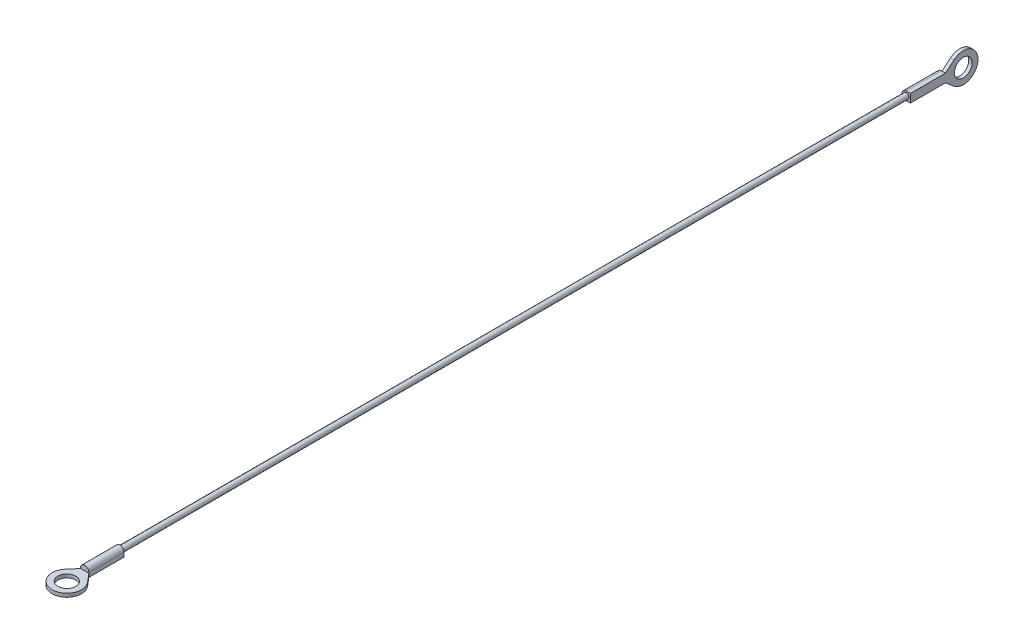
ISO-10303-21;
HEADER;
FILE_DESCRIPTION(('STEP AP214'),'2;1');
FILE_NAME('part.step','',(''),(''),'','','');
FILE_SCHEMA(('AUTOMOTIVE_DESIGN { 1 0 10303 214 1 1 1 1 }'));
ENDSEC;
DATA;
#1=APPLICATION_CONTEXT('core data for automotive mechanical design processes');
#2=APPLICATION_PROTOCOL_DEFINITION('international standard','automotive_design',2000,#1);
#3=PRODUCT_CONTEXT('',#1,'mechanical');
#4=PRODUCT('Part','Part','',(#3));
#5=PRODUCT_RELATED_PRODUCT_CATEGORY('part','',(#4));
#6=PRODUCT_DEFINITION_FORMATION('','',#4);
#7=PRODUCT_DEFINITION_CONTEXT('part definition',#1,'design');
#8=PRODUCT_DEFINITION('design','',#6,#7);
#9=PRODUCT_DEFINITION_SHAPE('','',#8);
#10=(LENGTH_UNIT() NAMED_UNIT(*) SI_UNIT(.MILLI.,.METRE.));
#11=(NAMED_UNIT(*) PLANE_ANGLE_UNIT() SI_UNIT($,.RADIAN.));
#12=(NAMED_UNIT(*) SI_UNIT($,.STERADIAN.) SOLID_ANGLE_UNIT());
#13=UNCERTAINTY_MEASURE_WITH_UNIT(LENGTH_MEASURE(1.E-05),#10,'distance_accuracy_value','');
#14=(GEOMETRIC_REPRESENTATION_CONTEXT(3) GLOBAL_UNCERTAINTY_ASSIGNED_CONTEXT((#13)) GLOBAL_UNIT_ASSIGNED_CONTEXT((#10,
#11,#12)) REPRESENTATION_CONTEXT('',''));
#15=CARTESIAN_POINT('',(0.,0.,0.));
#16=DIRECTION('',(0.,0.,1.));
#17=DIRECTION('',(1.,0.,0.));
#18=AXIS2_PLACEMENT_3D('',#15,#16,#17);
#19=CARTESIAN_POINT('',(0.,0.,-121.92));
#20=DIRECTION('',(0.,0.,-1.));
#21=DIRECTION('',(-1.,0.,0.));
#22=AXIS2_PLACEMENT_3D('',#19,#20,#21);
#23=PLANE('',#22);
#24=DIRECTION('',(1.,0.,0.));
#25=VECTOR('',#24,1.);
#26=CARTESIAN_POINT('',(0.,1.195,-121.92));
#27=LINE('',#26,#25);
#28=CARTESIAN_POINT('',(0.,1.195,-121.92));
#29=VERTEX_POINT('',#28);
#30=CARTESIAN_POINT('',(0.185,1.195,-121.92));
#31=VERTEX_POINT('',#30);
#32=EDGE_CURVE('E196',#29,#31,#27,.T.);
#33=ORIENTED_EDGE('',*,*,#32,.T.);
#34=DIRECTION('',(0.,-1.,0.));
#35=VECTOR('',#34,1.);
#36=CARTESIAN_POINT('',(0.185,-1.195,-121.92));
#37=LINE('',#36,#35);
#38=CARTESIAN_POINT('',(0.185,-1.195,-121.92));
#39=VERTEX_POINT('',#38);
#40=EDGE_CURVE('E154',#31,#39,#37,.T.);
#41=ORIENTED_EDGE('',*,*,#40,.T.);
#42=DIRECTION('',(-1.,0.,0.));
#43=VECTOR('',#42,1.);
#44=CARTESIAN_POINT('',(1.195,-1.195,-121.92));
#45=LINE('',#44,#43);
#46=CARTESIAN_POINT('',(0.,-1.195,-121.92));
#47=VERTEX_POINT('',#46);
#48=EDGE_CURVE('E201',#39,#47,#45,.T.);
#49=ORIENTED_EDGE('',*,*,#48,.T.);
#50=CARTESIAN_POINT('',(0.,0.,-121.92));
#51=DIRECTION('',(0.,0.,-1.));
#52=DIRECTION('',(-1.,0.,0.));
#53=AXIS2_PLACEMENT_3D('',#50,#51,#52);
#54=CIRCLE('',#53,1.195);
#55=EDGE_CURVE('E192',#47,#29,#54,.T.);
#56=ORIENTED_EDGE('',*,*,#55,.T.);
#57=EDGE_LOOP('',(#33,#41,#49,#56));
#58=FACE_BOUND('',#57,.T.);
#59=ADVANCED_FACE('F39',(#58),#23,.T.);
#60=CARTESIAN_POINT('',(0.,0.,121.92));
#61=DIRECTION('',(0.,0.,1.));
#62=DIRECTION('',(1.,0.,0.));
#63=AXIS2_PLACEMENT_3D('',#60,#61,#62);
#64=PLANE('',#63);
#65=DIRECTION('',(0.,-1.,0.));
#66=VECTOR('',#65,1.);
#67=CARTESIAN_POINT('',(-1.195,0.,121.92));
#68=LINE('',#67,#66);
#69=CARTESIAN_POINT('',(-1.195,0.,121.92));
#70=VERTEX_POINT('',#69);
#71=CARTESIAN_POINT('',(-1.195,-0.185,121.92));
#72=VERTEX_POINT('',#71);
#73=EDGE_CURVE('E279',#70,#72,#68,.T.);
#74=ORIENTED_EDGE('',*,*,#73,.T.);
#75=DIRECTION('',(1.,0.,0.));
#76=VECTOR('',#75,1.);
#77=CARTESIAN_POINT('',(-1.195,-0.185,121.92));
#78=LINE('',#77,#76);
#79=CARTESIAN_POINT('',(1.195,-0.185,121.92));
#80=VERTEX_POINT('',#79);
#81=EDGE_CURVE('E240',#72,#80,#78,.T.);
#82=ORIENTED_EDGE('',*,*,#81,.T.);
#83=DIRECTION('',(0.,1.,0.));
#84=VECTOR('',#83,1.);
#85=CARTESIAN_POINT('',(1.195,-1.195,121.92));
#86=LINE('',#85,#84);
#87=CARTESIAN_POINT('',(1.195,0.,121.92));
#88=VERTEX_POINT('',#87);
#89=EDGE_CURVE('E284',#80,#88,#86,.T.);
#90=ORIENTED_EDGE('',*,*,#89,.T.);
#91=CARTESIAN_POINT('',(0.,0.,121.92));
#92=DIRECTION('',(0.,0.,1.));
#93=DIRECTION('',(1.,0.,0.));
#94=AXIS2_PLACEMENT_3D('',#91,#92,#93);
#95=CIRCLE('',#94,1.195);
#96=EDGE_CURVE('E275',#88,#70,#95,.T.);
#97=ORIENTED_EDGE('',*,*,#96,.T.);
#98=EDGE_LOOP('',(#74,#82,#90,#97));
#99=FACE_BOUND('',#98,.T.);
#100=ADVANCED_FACE('F339',(#99),#64,.T.);
#101=CARTESIAN_POINT('',(0.,0.,111.92));
#102=DIRECTION('',(0.,0.,-1.));
#103=DIRECTION('',(-1.,0.,0.));
#104=AXIS2_PLACEMENT_3D('',#101,#102,#103);
#105=CYLINDRICAL_SURFACE('',#104,0.795);
#106=CARTESIAN_POINT('',(0.,0.,111.92));
#107=DIRECTION('',(0.,0.,1.));
#108=DIRECTION('',(1.,0.,0.));
#109=AXIS2_PLACEMENT_3D('',#106,#107,#108);
#110=CIRCLE('',#109,0.795);
#111=CARTESIAN_POINT('',(0.795,0.,111.92));
#112=VERTEX_POINT('',#111);
#113=EDGE_CURVE('E11',#112,#112,#110,.T.);
#114=ORIENTED_EDGE('',*,*,#113,.F.);
#115=EDGE_LOOP('',(#114));
#116=FACE_BOUND('',#115,.T.);
#117=CARTESIAN_POINT('',(0.,0.,-111.92));
#118=DIRECTION('',(0.,0.,1.));
#119=DIRECTION('',(1.,0.,0.));
#120=AXIS2_PLACEMENT_3D('',#117,#118,#119);
#121=CIRCLE('',#120,0.795);
#122=CARTESIAN_POINT('',(0.795,0.,-111.92));
#123=VERTEX_POINT('',#122);
#124=EDGE_CURVE('E43',#123,#123,#121,.T.);
#125=ORIENTED_EDGE('',*,*,#124,.T.);
#126=EDGE_LOOP('',(#125));
#127=FACE_BOUND('',#126,.T.);
#128=ADVANCED_FACE('F41',(#116,#127),#105,.T.);
#129=CARTESIAN_POINT('',(0.,0.,121.92));
#130=DIRECTION('',(0.,0.,-1.));
#131=DIRECTION('',(-1.,0.,0.));
#132=AXIS2_PLACEMENT_3D('',#129,#130,#131);
#133=CYLINDRICAL_SURFACE('',#132,1.195);
#134=CARTESIAN_POINT('',(0.,0.,111.92));
#135=DIRECTION('',(0.,0.,1.));
#136=DIRECTION('',(1.,0.,0.));
#137=AXIS2_PLACEMENT_3D('',#134,#135,#136);
#138=CIRCLE('',#137,1.195);
#139=CARTESIAN_POINT('',(1.195,0.,111.92));
#140=VERTEX_POINT('',#139);
#141=CARTESIAN_POINT('',(-1.195,0.,111.92));
#142=VERTEX_POINT('',#141);
#143=EDGE_CURVE('E269',#140,#142,#138,.T.);
#144=ORIENTED_EDGE('',*,*,#143,.T.);
#145=DIRECTION('',(0.,0.,-1.));
#146=VECTOR('',#145,1.);
#147=CARTESIAN_POINT('',(-1.195,0.,121.92));
#148=LINE('',#147,#146);
#149=EDGE_CURVE('E49',#70,#142,#148,.T.);
#150=ORIENTED_EDGE('',*,*,#149,.F.);
#151=ORIENTED_EDGE('',*,*,#96,.F.);
#152=DIRECTION('',(0.,0.,-1.));
#153=VECTOR('',#152,1.);
#154=CARTESIAN_POINT('',(1.195,0.,121.92));
#155=LINE('',#154,#153);
#156=EDGE_CURVE('E288',#88,#140,#155,.T.);
#157=ORIENTED_EDGE('',*,*,#156,.T.);
#158=EDGE_LOOP('',(#144,#150,#151,#157));
#159=FACE_BOUND('',#158,.T.);
#160=ADVANCED_FACE('F323',(#159),#133,.T.);
#161=CARTESIAN_POINT('',(-1.195,0.,121.92));
#162=DIRECTION('',(1.,0.,0.));
#163=DIRECTION('',(0.,1.,0.));
#164=AXIS2_PLACEMENT_3D('',#161,#162,#163);
#165=PLANE('',#164);
#166=DIRECTION('',(0.,-1.,0.));
#167=VECTOR('',#166,1.);
#168=CARTESIAN_POINT('',(-1.195,0.,111.92));
#169=LINE('',#168,#167);
#170=CARTESIAN_POINT('',(-1.195,-1.195,111.92));
#171=VERTEX_POINT('',#170);
#172=EDGE_CURVE('E292',#142,#171,#169,.T.);
#173=ORIENTED_EDGE('',*,*,#172,.T.);
#174=DIRECTION('',(0.,0.,-1.));
#175=VECTOR('',#174,1.);
#176=CARTESIAN_POINT('',(-1.195,-1.195,121.92));
#177=LINE('',#176,#175);
#178=CARTESIAN_POINT('',(-1.195,-1.195,121.92));
#179=VERTEX_POINT('',#178);
#180=EDGE_CURVE('E308',#179,#171,#177,.T.);
#181=ORIENTED_EDGE('',*,*,#180,.F.);
#182=DIRECTION('',(0.,-1.,0.));
#183=VECTOR('',#182,1.);
#184=CARTESIAN_POINT('',(-1.195,-0.185,121.92));
#185=LINE('',#184,#183);
#186=EDGE_CURVE('E266',#72,#179,#185,.T.);
#187=ORIENTED_EDGE('',*,*,#186,.F.);
#188=ORIENTED_EDGE('',*,*,#73,.F.);
#189=ORIENTED_EDGE('',*,*,#149,.T.);
#190=EDGE_LOOP('',(#173,#181,#187,#188,#189));
#191=FACE_BOUND('',#190,.T.);
#192=ADVANCED_FACE('F317',(#191),#165,.F.);
#193=CARTESIAN_POINT('',(0.,-1.195,121.92));
#194=DIRECTION('',(0.,1.,0.));
#195=DIRECTION('',(0.,0.,1.));
#196=AXIS2_PLACEMENT_3D('',#193,#194,#195);
#197=PLANE('',#196);
#198=DIRECTION('',(1.,0.,0.));
#199=VECTOR('',#198,1.);
#200=CARTESIAN_POINT('',(0.,-1.195,111.92));
#201=LINE('',#200,#199);
#202=CARTESIAN_POINT('',(1.195,-1.195,111.92));
#203=VERTEX_POINT('',#202);
#204=EDGE_CURVE('E296',#171,#203,#201,.T.);
#205=ORIENTED_EDGE('',*,*,#204,.T.);
#206=DIRECTION('',(0.,0.,-1.));
#207=VECTOR('',#206,1.);
#208=CARTESIAN_POINT('',(1.195,-1.195,121.92));
#209=LINE('',#208,#207);
#210=CARTESIAN_POINT('',(1.195,-1.195,121.92));
#211=VERTEX_POINT('',#210);
#212=EDGE_CURVE('E304',#211,#203,#209,.T.);
#213=ORIENTED_EDGE('',*,*,#212,.F.);
#214=DIRECTION('',(0.645049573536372,0.,0.764140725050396));
#215=VECTOR('',#214,1.);
#216=CARTESIAN_POINT('',(1.195,-1.195,121.92));
#217=LINE('',#216,#215);
#218=CARTESIAN_POINT('',(3.20174963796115,-1.195,124.297242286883));
#219=VERTEX_POINT('',#218);
#220=EDGE_CURVE('E235',#211,#219,#217,.T.);
#221=ORIENTED_EDGE('',*,*,#220,.T.);
#222=CARTESIAN_POINT('',(0.,-1.195,127.));
#223=DIRECTION('',(0.,-1.,0.));
#224=DIRECTION('',(0.,0.,-1.));
#225=AXIS2_PLACEMENT_3D('',#222,#223,#224);
#226=CIRCLE('',#225,4.18999999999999);
#227=CARTESIAN_POINT('',(-3.20174963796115,-1.195,124.297242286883));
#228=VERTEX_POINT('',#227);
#229=EDGE_CURVE('E259',#219,#228,#226,.T.);
#230=ORIENTED_EDGE('',*,*,#229,.T.);
#231=DIRECTION('',(0.645049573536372,0.,-0.764140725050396));
#232=VECTOR('',#231,1.);
#233=CARTESIAN_POINT('',(-3.20174963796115,-1.195,124.297242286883));
#234=LINE('',#233,#232);
#235=EDGE_CURVE('E244',#228,#179,#234,.T.);
#236=ORIENTED_EDGE('',*,*,#235,.T.);
#237=ORIENTED_EDGE('',*,*,#180,.T.);
#238=EDGE_LOOP('',(#205,#213,#221,#230,#236,#237));
#239=FACE_BOUND('',#238,.T.);
#240=CARTESIAN_POINT('',(0.,-1.195,127.));
#241=DIRECTION('',(0.,-1.,0.));
#242=DIRECTION('',(0.,0.,-1.));
#243=AXIS2_PLACEMENT_3D('',#240,#241,#242);
#244=CIRCLE('',#243,2.54);
#245=CARTESIAN_POINT('',(0.,-1.195,124.46));
#246=VERTEX_POINT('',#245);
#247=EDGE_CURVE('E236',#246,#246,#244,.T.);
#248=ORIENTED_EDGE('',*,*,#247,.F.);
#249=EDGE_LOOP('',(#248));
#250=FACE_BOUND('',#249,.T.);
#251=ADVANCED_FACE('F330',(#239,#250),#197,.F.);
#252=CARTESIAN_POINT('',(1.195,-1.195,121.92));
#253=DIRECTION('',(-1.,0.,0.));
#254=DIRECTION('',(0.,-1.,0.));
#255=AXIS2_PLACEMENT_3D('',#252,#253,#254);
#256=PLANE('',#255);
#257=DIRECTION('',(0.,1.,0.));
#258=VECTOR('',#257,1.);
#259=CARTESIAN_POINT('',(1.195,-1.195,111.92));
#260=LINE('',#259,#258);
#261=EDGE_CURVE('E280',#203,#140,#260,.T.);
#262=ORIENTED_EDGE('',*,*,#261,.T.);
#263=ORIENTED_EDGE('',*,*,#156,.F.);
#264=ORIENTED_EDGE('',*,*,#89,.F.);
#265=EDGE_CURVE('E285',#211,#80,#86,.T.);
#266=ORIENTED_EDGE('',*,*,#265,.F.);
#267=ORIENTED_EDGE('',*,*,#212,.T.);
#268=EDGE_LOOP('',(#262,#263,#264,#266,#267));
#269=FACE_BOUND('',#268,.T.);
#270=ADVANCED_FACE('F334',(#269),#256,.F.);
#271=CARTESIAN_POINT('',(0.,0.,111.92));
#272=DIRECTION('',(0.,0.,1.));
#273=DIRECTION('',(1.,0.,0.));
#274=AXIS2_PLACEMENT_3D('',#271,#272,#273);
#275=PLANE('',#274);
#276=ORIENTED_EDGE('',*,*,#113,.T.);
#277=EDGE_LOOP('',(#276));
#278=FACE_BOUND('',#277,.T.);
#279=ORIENTED_EDGE('',*,*,#143,.F.);
#280=ORIENTED_EDGE('',*,*,#261,.F.);
#281=ORIENTED_EDGE('',*,*,#204,.F.);
#282=ORIENTED_EDGE('',*,*,#172,.F.);
#283=EDGE_LOOP('',(#279,#280,#281,#282));
#284=FACE_BOUND('',#283,.T.);
#285=ADVANCED_FACE('F327',(#278,#284),#275,.F.);
#286=CARTESIAN_POINT('',(-3.20174963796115,-0.185,124.297242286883));
#287=DIRECTION('',(-0.764140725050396,0.,-0.645049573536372));
#288=DIRECTION('',(-0.645049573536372,0.,0.764140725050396));
#289=AXIS2_PLACEMENT_3D('',#286,#287,#288);
#290=PLANE('',#289);
#291=ORIENTED_EDGE('',*,*,#235,.F.);
#292=DIRECTION('',(0.,-1.,0.));
#293=VECTOR('',#292,1.);
#294=CARTESIAN_POINT('',(-3.20174963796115,-0.185,124.297242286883));
#295=LINE('',#294,#293);
#296=CARTESIAN_POINT('',(-3.20174963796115,-0.185,124.297242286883));
#297=VERTEX_POINT('',#296);
#298=EDGE_CURVE('E270',#297,#228,#295,.T.);
#299=ORIENTED_EDGE('',*,*,#298,.F.);
#300=DIRECTION('',(0.645049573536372,0.,-0.764140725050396));
#301=VECTOR('',#300,1.);
#302=CARTESIAN_POINT('',(-3.20174963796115,-0.185,124.297242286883));
#303=LINE('',#302,#301);
#304=EDGE_CURVE('E251',#297,#72,#303,.T.);
#305=ORIENTED_EDGE('',*,*,#304,.T.);
#306=ORIENTED_EDGE('',*,*,#186,.T.);
#307=EDGE_LOOP('',(#291,#299,#305,#306));
#308=FACE_BOUND('',#307,.T.);
#309=ADVANCED_FACE('F344',(#308),#290,.T.);
#310=CARTESIAN_POINT('',(0.,-0.185,127.));
#311=DIRECTION('',(0.,-1.,0.));
#312=DIRECTION('',(0.,0.,-1.));
#313=AXIS2_PLACEMENT_3D('',#310,#311,#312);
#314=CYLINDRICAL_SURFACE('',#313,4.18999999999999);
#315=ORIENTED_EDGE('',*,*,#229,.F.);
#316=DIRECTION('',(0.,-1.,0.));
#317=VECTOR('',#316,1.);
#318=CARTESIAN_POINT('',(3.20174963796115,-0.185,124.297242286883));
#319=LINE('',#318,#317);
#320=CARTESIAN_POINT('',(3.20174963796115,-0.185,124.297242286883));
#321=VERTEX_POINT('',#320);
#322=EDGE_CURVE('E255',#321,#219,#319,.T.);
#323=ORIENTED_EDGE('',*,*,#322,.F.);
#324=CARTESIAN_POINT('',(0.,-0.185,127.));
#325=DIRECTION('',(0.,-1.,0.));
#326=DIRECTION('',(0.,0.,-1.));
#327=AXIS2_PLACEMENT_3D('',#324,#325,#326);
#328=CIRCLE('',#327,4.18999999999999);
#329=EDGE_CURVE('E247',#321,#297,#328,.T.);
#330=ORIENTED_EDGE('',*,*,#329,.T.);
#331=ORIENTED_EDGE('',*,*,#298,.T.);
#332=EDGE_LOOP('',(#315,#323,#330,#331));
#333=FACE_BOUND('',#332,.T.);
#334=ADVANCED_FACE('F347',(#333),#314,.T.);
#335=CARTESIAN_POINT('',(1.195,-0.185,121.92));
#336=DIRECTION('',(0.764140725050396,0.,-0.645049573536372));
#337=DIRECTION('',(-0.645049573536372,0.,-0.764140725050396));
#338=AXIS2_PLACEMENT_3D('',#335,#336,#337);
#339=PLANE('',#338);
#340=ORIENTED_EDGE('',*,*,#220,.F.);
#341=ORIENTED_EDGE('',*,*,#265,.T.);
#342=DIRECTION('',(0.645049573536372,0.,0.764140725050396));
#343=VECTOR('',#342,1.);
#344=CARTESIAN_POINT('',(1.195,-0.185,121.92));
#345=LINE('',#344,#343);
#346=EDGE_CURVE('E64',#80,#321,#345,.T.);
#347=ORIENTED_EDGE('',*,*,#346,.T.);
#348=ORIENTED_EDGE('',*,*,#322,.T.);
#349=EDGE_LOOP('',(#340,#341,#347,#348));
#350=FACE_BOUND('',#349,.T.);
#351=ADVANCED_FACE('F337',(#350),#339,.T.);
#352=CARTESIAN_POINT('',(0.,-0.185,127.));
#353=DIRECTION('',(0.,-1.,0.));
#354=DIRECTION('',(0.,0.,-1.));
#355=AXIS2_PLACEMENT_3D('',#352,#353,#354);
#356=PLANE('',#355);
#357=CARTESIAN_POINT('',(0.,-0.185,127.));
#358=DIRECTION('',(0.,-1.,0.));
#359=DIRECTION('',(0.,0.,-1.));
#360=AXIS2_PLACEMENT_3D('',#357,#358,#359);
#361=CIRCLE('',#360,2.54);
#362=CARTESIAN_POINT('',(0.,-0.185,124.46));
#363=VERTEX_POINT('',#362);
#364=EDGE_CURVE('E231',#363,#363,#361,.T.);
#365=ORIENTED_EDGE('',*,*,#364,.T.);
#366=EDGE_LOOP('',(#365));
#367=FACE_BOUND('',#366,.T.);
#368=ORIENTED_EDGE('',*,*,#81,.F.);
#369=ORIENTED_EDGE('',*,*,#304,.F.);
#370=ORIENTED_EDGE('',*,*,#329,.F.);
#371=ORIENTED_EDGE('',*,*,#346,.F.);
#372=EDGE_LOOP('',(#368,#369,#370,#371));
#373=FACE_BOUND('',#372,.T.);
#374=ADVANCED_FACE('F341',(#367,#373),#356,.F.);
#375=CARTESIAN_POINT('',(0.,-0.185,127.));
#376=DIRECTION('',(0.,-1.,0.));
#377=DIRECTION('',(0.,0.,-1.));
#378=AXIS2_PLACEMENT_3D('',#375,#376,#377);
#379=CYLINDRICAL_SURFACE('',#378,2.54);
#380=ORIENTED_EDGE('',*,*,#364,.F.);
#381=EDGE_LOOP('',(#380));
#382=FACE_BOUND('',#381,.T.);
#383=ORIENTED_EDGE('',*,*,#247,.T.);
#384=EDGE_LOOP('',(#383));
#385=FACE_BOUND('',#384,.T.);
#386=ADVANCED_FACE('F385',(#382,#385),#379,.F.);
#387=CARTESIAN_POINT('',(0.,0.,-121.92));
#388=DIRECTION('',(0.,0.,1.));
#389=DIRECTION('',(1.,0.,0.));
#390=AXIS2_PLACEMENT_3D('',#387,#388,#389);
#391=CYLINDRICAL_SURFACE('',#390,1.195);
#392=CARTESIAN_POINT('',(0.,0.,-111.92));
#393=DIRECTION('',(0.,0.,-1.));
#394=DIRECTION('',(-1.,0.,0.));
#395=AXIS2_PLACEMENT_3D('',#392,#393,#394);
#396=CIRCLE('',#395,1.195);
#397=CARTESIAN_POINT('',(0.,-1.195,-111.92));
#398=VERTEX_POINT('',#397);
#399=CARTESIAN_POINT('',(0.,1.195,-111.92));
#400=VERTEX_POINT('',#399);
#401=EDGE_CURVE('E189',#398,#400,#396,.T.);
#402=ORIENTED_EDGE('',*,*,#401,.T.);
#403=DIRECTION('',(0.,0.,1.));
#404=VECTOR('',#403,1.);
#405=CARTESIAN_POINT('',(0.,1.195,-121.92));
#406=LINE('',#405,#404);
#407=EDGE_CURVE('E228',#29,#400,#406,.T.);
#408=ORIENTED_EDGE('',*,*,#407,.F.);
#409=ORIENTED_EDGE('',*,*,#55,.F.);
#410=DIRECTION('',(0.,0.,1.));
#411=VECTOR('',#410,1.);
#412=CARTESIAN_POINT('',(0.,-1.195,-121.92));
#413=LINE('',#412,#411);
#414=EDGE_CURVE('E204',#47,#398,#413,.T.);
#415=ORIENTED_EDGE('',*,*,#414,.T.);
#416=EDGE_LOOP('',(#402,#408,#409,#415));
#417=FACE_BOUND('',#416,.T.);
#418=ADVANCED_FACE('F381',(#417),#391,.T.);
#419=CARTESIAN_POINT('',(0.,1.195,-121.92));
#420=DIRECTION('',(0.,-1.,0.));
#421=DIRECTION('',(0.,0.,-1.));
#422=AXIS2_PLACEMENT_3D('',#419,#420,#421);
#423=PLANE('',#422);
#424=DIRECTION('',(1.,0.,0.));
#425=VECTOR('',#424,1.);
#426=CARTESIAN_POINT('',(0.,1.195,-111.92));
#427=LINE('',#426,#425);
#428=CARTESIAN_POINT('',(1.195,1.195,-111.92));
#429=VERTEX_POINT('',#428);
#430=EDGE_CURVE('E208',#400,#429,#427,.T.);
#431=ORIENTED_EDGE('',*,*,#430,.T.);
#432=DIRECTION('',(0.,0.,1.));
#433=VECTOR('',#432,1.);
#434=CARTESIAN_POINT('',(1.195,1.195,-121.92));
#435=LINE('',#434,#433);
#436=CARTESIAN_POINT('',(1.195,1.195,-121.92));
#437=VERTEX_POINT('',#436);
#438=EDGE_CURVE('E224',#437,#429,#435,.T.);
#439=ORIENTED_EDGE('',*,*,#438,.F.);
#440=DIRECTION('',(1.,0.,0.));
#441=VECTOR('',#440,1.);
#442=CARTESIAN_POINT('',(0.185,1.195,-121.92));
#443=LINE('',#442,#441);
#444=EDGE_CURVE('E186',#31,#437,#443,.T.);
#445=ORIENTED_EDGE('',*,*,#444,.F.);
#446=ORIENTED_EDGE('',*,*,#32,.F.);
#447=ORIENTED_EDGE('',*,*,#407,.T.);
#448=EDGE_LOOP('',(#431,#439,#445,#446,#447));
#449=FACE_BOUND('',#448,.T.);
#450=ADVANCED_FACE('F377',(#449),#423,.F.);
#451=CARTESIAN_POINT('',(1.195,0.,-121.92));
#452=DIRECTION('',(-1.,0.,0.));
#453=DIRECTION('',(0.,-1.,0.));
#454=AXIS2_PLACEMENT_3D('',#451,#452,#453);
#455=PLANE('',#454);
#456=DIRECTION('',(0.,-1.,0.));
#457=VECTOR('',#456,1.);
#458=CARTESIAN_POINT('',(1.195,0.,-111.92));
#459=LINE('',#458,#457);
#460=CARTESIAN_POINT('',(1.195,-1.195,-111.92));
#461=VERTEX_POINT('',#460);
#462=EDGE_CURVE('E212',#429,#461,#459,.T.);
#463=ORIENTED_EDGE('',*,*,#462,.T.);
#464=DIRECTION('',(0.,0.,1.));
#465=VECTOR('',#464,1.);
#466=CARTESIAN_POINT('',(1.195,-1.195,-121.92));
#467=LINE('',#466,#465);
#468=CARTESIAN_POINT('',(1.195,-1.195,-121.92));
#469=VERTEX_POINT('',#468);
#470=EDGE_CURVE('E220',#469,#461,#467,.T.);
#471=ORIENTED_EDGE('',*,*,#470,.F.);
#472=DIRECTION('',(0.,-0.645049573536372,-0.764140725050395));
#473=VECTOR('',#472,1.);
#474=CARTESIAN_POINT('',(1.195,-3.20174963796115,-124.297242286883));
#475=LINE('',#474,#473);
#476=CARTESIAN_POINT('',(1.195,-3.20174963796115,-124.297242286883));
#477=VERTEX_POINT('',#476);
#478=EDGE_CURVE('E180',#469,#477,#475,.T.);
#479=ORIENTED_EDGE('',*,*,#478,.T.);
#480=CARTESIAN_POINT('',(1.195,0.,-127.));
#481=DIRECTION('',(1.,0.,0.));
#482=DIRECTION('',(0.,0.,1.));
#483=AXIS2_PLACEMENT_3D('',#480,#481,#482);
#484=CIRCLE('',#483,4.18999999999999);
#485=CARTESIAN_POINT('',(1.195,3.20174963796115,-124.297242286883));
#486=VERTEX_POINT('',#485);
#487=EDGE_CURVE('E149',#477,#486,#484,.T.);
#488=ORIENTED_EDGE('',*,*,#487,.T.);
#489=DIRECTION('',(0.,-0.645049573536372,0.764140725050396));
#490=VECTOR('',#489,1.);
#491=CARTESIAN_POINT('',(1.195,1.195,-121.92));
#492=LINE('',#491,#490);
#493=EDGE_CURVE('E166',#486,#437,#492,.T.);
#494=ORIENTED_EDGE('',*,*,#493,.T.);
#495=ORIENTED_EDGE('',*,*,#438,.T.);
#496=EDGE_LOOP('',(#463,#471,#479,#488,#494,#495));
#497=FACE_BOUND('',#496,.T.);
#498=CARTESIAN_POINT('',(1.195,0.,-127.));
#499=DIRECTION('',(1.,0.,0.));
#500=DIRECTION('',(0.,0.,-1.));
#501=AXIS2_PLACEMENT_3D('',#498,#499,#500);
#502=CIRCLE('',#501,2.53999999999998);
#503=CARTESIAN_POINT('',(1.195,0.,-129.54));
#504=VERTEX_POINT('',#503);
#505=EDGE_CURVE('E173',#504,#504,#502,.T.);
#506=ORIENTED_EDGE('',*,*,#505,.F.);
#507=EDGE_LOOP('',(#506));
#508=FACE_BOUND('',#507,.T.);
#509=ADVANCED_FACE('F373',(#497,#508),#455,.F.);
#510=CARTESIAN_POINT('',(1.195,-1.195,-121.92));
#511=DIRECTION('',(0.,1.,0.));
#512=DIRECTION('',(0.,0.,1.));
#513=AXIS2_PLACEMENT_3D('',#510,#511,#512);
#514=PLANE('',#513);
#515=DIRECTION('',(-1.,0.,0.));
#516=VECTOR('',#515,1.);
#517=CARTESIAN_POINT('',(1.195,-1.195,-111.92));
#518=LINE('',#517,#516);
#519=EDGE_CURVE('E197',#461,#398,#518,.T.);
#520=ORIENTED_EDGE('',*,*,#519,.T.);
#521=ORIENTED_EDGE('',*,*,#414,.F.);
#522=ORIENTED_EDGE('',*,*,#48,.F.);
#523=EDGE_CURVE('E163',#469,#39,#45,.T.);
#524=ORIENTED_EDGE('',*,*,#523,.F.);
#525=ORIENTED_EDGE('',*,*,#470,.T.);
#526=EDGE_LOOP('',(#520,#521,#522,#524,#525));
#527=FACE_BOUND('',#526,.T.);
#528=ADVANCED_FACE('F369',(#527),#514,.F.);
#529=CARTESIAN_POINT('',(0.,0.,-111.92));
#530=DIRECTION('',(0.,0.,-1.));
#531=DIRECTION('',(-1.,0.,0.));
#532=AXIS2_PLACEMENT_3D('',#529,#530,#531);
#533=PLANE('',#532);
#534=ORIENTED_EDGE('',*,*,#124,.F.);
#535=EDGE_LOOP('',(#534));
#536=FACE_BOUND('',#535,.T.);
#537=ORIENTED_EDGE('',*,*,#401,.F.);
#538=ORIENTED_EDGE('',*,*,#519,.F.);
#539=ORIENTED_EDGE('',*,*,#462,.F.);
#540=ORIENTED_EDGE('',*,*,#430,.F.);
#541=EDGE_LOOP('',(#537,#538,#539,#540));
#542=FACE_BOUND('',#541,.T.);
#543=ADVANCED_FACE('F366',(#536,#542),#533,.F.);
#544=CARTESIAN_POINT('',(0.185,-3.20174963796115,-124.297242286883));
#545=DIRECTION('',(0.,-0.764140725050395,0.645049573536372));
#546=DIRECTION('',(0.,-0.645049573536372,-0.764140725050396));
#547=AXIS2_PLACEMENT_3D('',#544,#545,#546);
#548=PLANE('',#547);
#549=ORIENTED_EDGE('',*,*,#478,.F.);
#550=ORIENTED_EDGE('',*,*,#523,.T.);
#551=DIRECTION('',(0.,-0.645049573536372,-0.764140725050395));
#552=VECTOR('',#551,1.);
#553=CARTESIAN_POINT('',(0.185,-3.20174963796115,-124.297242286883));
#554=LINE('',#553,#552);
#555=CARTESIAN_POINT('',(0.185,-3.20174963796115,-124.297242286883));
#556=VERTEX_POINT('',#555);
#557=EDGE_CURVE('E56',#39,#556,#554,.T.);
#558=ORIENTED_EDGE('',*,*,#557,.T.);
#559=DIRECTION('',(1.,0.,0.));
#560=VECTOR('',#559,1.);
#561=CARTESIAN_POINT('',(0.185,-3.20174963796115,-124.297242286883));
#562=LINE('',#561,#560);
#563=EDGE_CURVE('E145',#556,#477,#562,.T.);
#564=ORIENTED_EDGE('',*,*,#563,.T.);
#565=EDGE_LOOP('',(#549,#550,#558,#564));
#566=FACE_BOUND('',#565,.T.);
#567=ADVANCED_FACE('F161',(#566),#548,.T.);
#568=CARTESIAN_POINT('',(0.185,1.195,-121.92));
#569=DIRECTION('',(0.,0.764140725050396,0.645049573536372));
#570=DIRECTION('',(0.,-0.645049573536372,0.764140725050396));
#571=AXIS2_PLACEMENT_3D('',#568,#569,#570);
#572=PLANE('',#571);
#573=ORIENTED_EDGE('',*,*,#493,.F.);
#574=DIRECTION('',(1.,0.,0.));
#575=VECTOR('',#574,1.);
#576=CARTESIAN_POINT('',(0.185,3.20174963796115,-124.297242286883));
#577=LINE('',#576,#575);
#578=CARTESIAN_POINT('',(0.185,3.20174963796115,-124.297242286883));
#579=VERTEX_POINT('',#578);
#580=EDGE_CURVE('E153',#579,#486,#577,.T.);
#581=ORIENTED_EDGE('',*,*,#580,.F.);
#582=DIRECTION('',(0.,-0.645049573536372,0.764140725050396));
#583=VECTOR('',#582,1.);
#584=CARTESIAN_POINT('',(0.185,1.195,-121.92));
#585=LINE('',#584,#583);
#586=EDGE_CURVE('E158',#579,#31,#585,.T.);
#587=ORIENTED_EDGE('',*,*,#586,.T.);
#588=ORIENTED_EDGE('',*,*,#444,.T.);
#589=EDGE_LOOP('',(#573,#581,#587,#588));
#590=FACE_BOUND('',#589,.T.);
#591=ADVANCED_FACE('F429',(#590),#572,.T.);
#592=CARTESIAN_POINT('',(0.185,0.,-127.));
#593=DIRECTION('',(1.,0.,0.));
#594=DIRECTION('',(0.,0.,-1.));
#595=AXIS2_PLACEMENT_3D('',#592,#593,#594);
#596=CYLINDRICAL_SURFACE('',#595,4.18999999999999);
#597=ORIENTED_EDGE('',*,*,#487,.F.);
#598=ORIENTED_EDGE('',*,*,#563,.F.);
#599=CARTESIAN_POINT('',(0.185,0.,-127.));
#600=DIRECTION('',(1.,0.,0.));
#601=DIRECTION('',(0.,0.,1.));
#602=AXIS2_PLACEMENT_3D('',#599,#600,#601);
#603=CIRCLE('',#602,4.18999999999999);
#604=EDGE_CURVE('E147',#556,#579,#603,.T.);
#605=ORIENTED_EDGE('',*,*,#604,.T.);
#606=ORIENTED_EDGE('',*,*,#580,.T.);
#607=EDGE_LOOP('',(#597,#598,#605,#606));
#608=FACE_BOUND('',#607,.T.);
#609=ADVANCED_FACE('F146',(#608),#596,.T.);
#610=CARTESIAN_POINT('',(0.185,0.,-127.));
#611=DIRECTION('',(-1.,0.,0.));
#612=DIRECTION('',(0.,0.,1.));
#613=AXIS2_PLACEMENT_3D('',#610,#611,#612);
#614=PLANE('',#613);
#615=CARTESIAN_POINT('',(0.185,0.,-127.));
#616=DIRECTION('',(1.,0.,0.));
#617=DIRECTION('',(0.,0.,-1.));
#618=AXIS2_PLACEMENT_3D('',#615,#616,#617);
#619=CIRCLE('',#618,2.53999999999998);
#620=CARTESIAN_POINT('',(0.185,0.,-129.54));
#621=VERTEX_POINT('',#620);
#622=EDGE_CURVE('E183',#621,#621,#619,.T.);
#623=ORIENTED_EDGE('',*,*,#622,.T.);
#624=EDGE_LOOP('',(#623));
#625=FACE_BOUND('',#624,.T.);
#626=ORIENTED_EDGE('',*,*,#557,.F.);
#627=ORIENTED_EDGE('',*,*,#40,.F.);
#628=ORIENTED_EDGE('',*,*,#586,.F.);
#629=ORIENTED_EDGE('',*,*,#604,.F.);
#630=EDGE_LOOP('',(#626,#627,#628,#629));
#631=FACE_BOUND('',#630,.T.);
#632=ADVANCED_FACE('F157',(#625,#631),#614,.T.);
#633=CARTESIAN_POINT('',(0.185,0.,-127.));
#634=DIRECTION('',(1.,0.,0.));
#635=DIRECTION('',(0.,0.,-1.));
#636=AXIS2_PLACEMENT_3D('',#633,#634,#635);
#637=CYLINDRICAL_SURFACE('',#636,2.53999999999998);
#638=ORIENTED_EDGE('',*,*,#622,.F.);
#639=EDGE_LOOP('',(#638));
#640=FACE_BOUND('',#639,.T.);
#641=ORIENTED_EDGE('',*,*,#505,.T.);
#642=EDGE_LOOP('',(#641));
#643=FACE_BOUND('',#642,.T.);
#644=ADVANCED_FACE('F442',(#640,#643),#637,.F.);
#645=CLOSED_SHELL('',(#59,#100,#128,#160,#192,#251,#270,#285,#309,#334,#351,#374,#386,#418,#450,
#509,#528,#543,#567,#591,#609,#632,#644));
#646=MANIFOLD_SOLID_BREP('B2',#645);
#647=ADVANCED_BREP_SHAPE_REPRESENTATION('',(#18,#646),#14);
#648=SHAPE_DEFINITION_REPRESENTATION(#9,#647);
ENDSEC;
END-ISO-10303-21;
